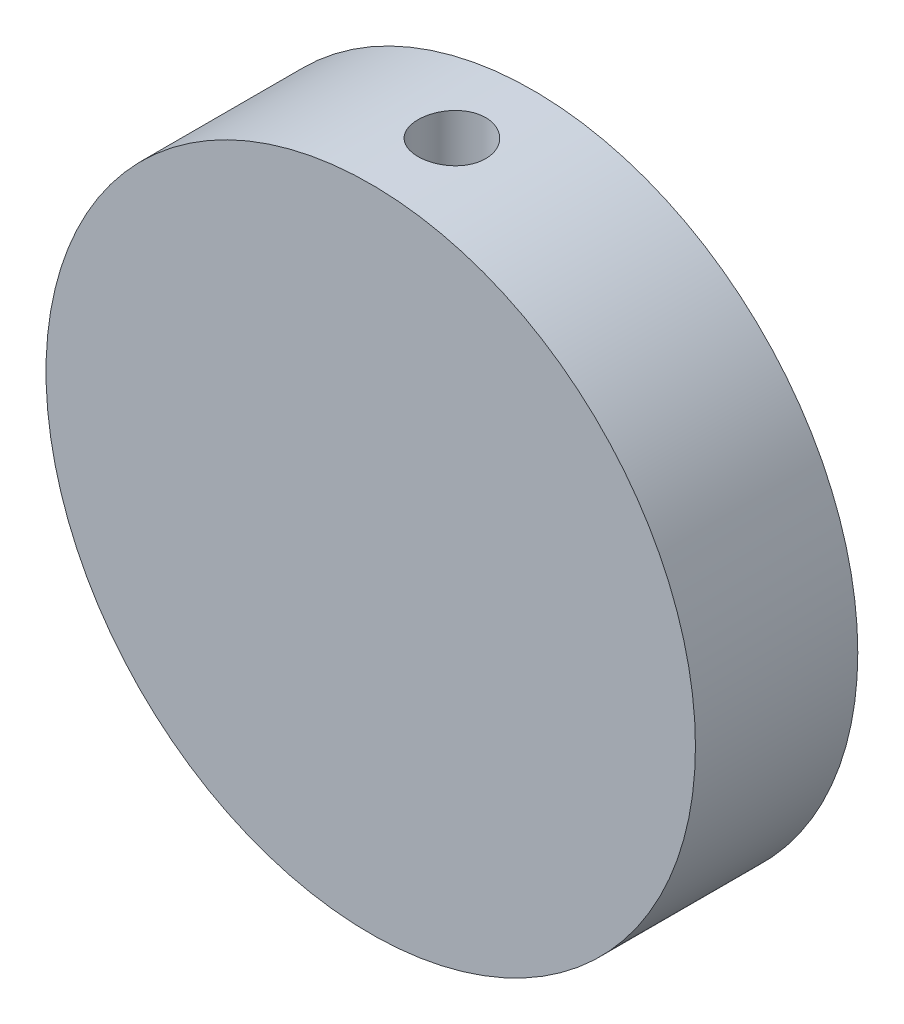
ISO-10303-21;
HEADER;
FILE_DESCRIPTION(('STEP AP214'),'2;1');
FILE_NAME('part.step','',(''),(''),'','','');
FILE_SCHEMA(('AUTOMOTIVE_DESIGN { 1 0 10303 214 1 1 1 1 }'));
ENDSEC;
DATA;
#1=APPLICATION_CONTEXT('core data for automotive mechanical design processes');
#2=APPLICATION_PROTOCOL_DEFINITION('international standard','automotive_design',2000,#1);
#3=PRODUCT_CONTEXT('',#1,'mechanical');
#4=PRODUCT('Part','Part','',(#3));
#5=PRODUCT_RELATED_PRODUCT_CATEGORY('part','',(#4));
#6=PRODUCT_DEFINITION_FORMATION('','',#4);
#7=PRODUCT_DEFINITION_CONTEXT('part definition',#1,'design');
#8=PRODUCT_DEFINITION('design','',#6,#7);
#9=PRODUCT_DEFINITION_SHAPE('','',#8);
#10=(LENGTH_UNIT() NAMED_UNIT(*) SI_UNIT(.MILLI.,.METRE.));
#11=(NAMED_UNIT(*) PLANE_ANGLE_UNIT() SI_UNIT($,.RADIAN.));
#12=(NAMED_UNIT(*) SI_UNIT($,.STERADIAN.) SOLID_ANGLE_UNIT());
#13=UNCERTAINTY_MEASURE_WITH_UNIT(LENGTH_MEASURE(1.E-05),#10,'distance_accuracy_value','');
#14=(GEOMETRIC_REPRESENTATION_CONTEXT(3) GLOBAL_UNCERTAINTY_ASSIGNED_CONTEXT((#13)) GLOBAL_UNIT_ASSIGNED_CONTEXT((#10,
#11,#12)) REPRESENTATION_CONTEXT('',''));
#15=CARTESIAN_POINT('',(0.,0.,0.));
#16=DIRECTION('',(0.,0.,1.));
#17=DIRECTION('',(1.,0.,0.));
#18=AXIS2_PLACEMENT_3D('',#15,#16,#17);
#19=CARTESIAN_POINT('',(0.,0.,6.));
#20=DIRECTION('',(0.,0.,-1.));
#21=DIRECTION('',(-1.,0.,0.));
#22=AXIS2_PLACEMENT_3D('',#19,#20,#21);
#23=CYLINDRICAL_SURFACE('',#22,12.);
#24=CARTESIAN_POINT('',(0.,-12.,4.25));
#25=CARTESIAN_POINT('',(0.0700095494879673,-11.9999991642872,4.2499969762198));
#26=CARTESIAN_POINT('',(0.140065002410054,-11.9993808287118,4.24409858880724));
#27=CARTESIAN_POINT('',(0.278232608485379,-11.9969736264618,4.22065842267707));
#28=CARTESIAN_POINT('',(0.346342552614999,-11.9951834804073,4.20310391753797));
#29=CARTESIAN_POINT('',(0.478598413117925,-11.9906346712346,4.15686904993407));
#30=CARTESIAN_POINT('',(0.542746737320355,-11.9878766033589,4.12819552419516));
#31=CARTESIAN_POINT('',(0.66530650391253,-11.9817001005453,4.06055009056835));
#32=CARTESIAN_POINT('',(0.723719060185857,-11.9782817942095,4.02158018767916));
#33=CARTESIAN_POINT('',(0.833390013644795,-11.9711526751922,3.93428570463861));
#34=CARTESIAN_POINT('',(0.884622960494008,-11.9674408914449,3.88592922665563));
#35=CARTESIAN_POINT('',(0.978261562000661,-11.9601511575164,3.78130238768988));
#36=CARTESIAN_POINT('',(1.02066680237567,-11.9565732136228,3.72503165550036));
#37=CARTESIAN_POINT('',(1.09553719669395,-11.9499464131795,3.60601329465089));
#38=CARTESIAN_POINT('',(1.12797918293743,-11.9468987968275,3.54325101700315));
#39=CARTESIAN_POINT('',(1.18185422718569,-11.9416898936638,3.41313259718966));
#40=CARTESIAN_POINT('',(1.20328757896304,-11.9395285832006,3.34577657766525));
#41=CARTESIAN_POINT('',(1.23446116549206,-11.9363458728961,3.20864305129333));
#42=CARTESIAN_POINT('',(1.24424374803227,-11.9353203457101,3.13887526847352));
#43=CARTESIAN_POINT('',(1.25196903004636,-11.9345125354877,2.99868114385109));
#44=CARTESIAN_POINT('',(1.24991206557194,-11.9347302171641,2.928254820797));
#45=CARTESIAN_POINT('',(1.23405152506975,-11.9363804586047,2.78903516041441));
#46=CARTESIAN_POINT('',(1.22029424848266,-11.9378082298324,2.72023648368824));
#47=CARTESIAN_POINT('',(1.1814956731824,-11.9417102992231,2.58592983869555));
#48=CARTESIAN_POINT('',(1.1564542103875,-11.9441846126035,2.52042191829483));
#49=CARTESIAN_POINT('',(1.09574719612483,-11.9499064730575,2.39441042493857));
#50=CARTESIAN_POINT('',(1.06006116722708,-11.953155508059,2.33391678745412));
#51=CARTESIAN_POINT('',(0.97909272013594,-11.9600594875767,2.21975979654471));
#52=CARTESIAN_POINT('',(0.93380999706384,-11.9637144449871,2.16609666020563));
#53=CARTESIAN_POINT('',(0.834675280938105,-11.9710397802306,2.06685497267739));
#54=CARTESIAN_POINT('',(0.780783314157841,-11.97471014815,2.02131634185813));
#55=CARTESIAN_POINT('',(0.666098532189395,-11.9816362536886,1.93992596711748));
#56=CARTESIAN_POINT('',(0.605305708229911,-11.9848919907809,1.90407423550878));
#57=CARTESIAN_POINT('',(0.478516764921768,-11.9906232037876,1.84307671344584));
#58=CARTESIAN_POINT('',(0.412519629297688,-11.9930985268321,1.81793302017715));
#59=CARTESIAN_POINT('',(0.277208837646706,-11.9969884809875,1.77909493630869));
#60=CARTESIAN_POINT('',(0.2078952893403,-11.9984031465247,1.7654001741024));
#61=CARTESIAN_POINT('',(0.0682648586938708,-12.0000079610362,1.74989950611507));
#62=CARTESIAN_POINT('',(-0.00204584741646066,-12.0002037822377,1.74803852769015));
#63=CARTESIAN_POINT('',(-0.141978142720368,-11.9993640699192,1.75611350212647));
#64=CARTESIAN_POINT('',(-0.211599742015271,-11.9983285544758,1.76604928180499));
#65=CARTESIAN_POINT('',(-0.348018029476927,-11.995146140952,1.79739003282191));
#66=CARTESIAN_POINT('',(-0.414820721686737,-11.9930017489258,1.81876914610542));
#67=CARTESIAN_POINT('',(-0.54389172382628,-11.98784207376,1.8723630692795));
#68=CARTESIAN_POINT('',(-0.606159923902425,-11.9848267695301,1.9045781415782));
#69=CARTESIAN_POINT('',(-0.72464291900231,-11.9782482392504,1.97906558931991));
#70=CARTESIAN_POINT('',(-0.780834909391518,-11.9746830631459,2.02137406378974));
#71=CARTESIAN_POINT('',(-0.885339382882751,-11.9674108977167,2.11479567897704));
#72=CARTESIAN_POINT('',(-0.933651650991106,-11.9637039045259,2.16590905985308));
#73=CARTESIAN_POINT('',(-1.02121712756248,-11.9565487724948,2.27573022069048));
#74=CARTESIAN_POINT('',(-1.06043413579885,-11.9531017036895,2.33446694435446));
#75=CARTESIAN_POINT('',(-1.12844682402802,-11.9468731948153,2.45772506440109));
#76=CARTESIAN_POINT('',(-1.15724265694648,-11.9440917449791,2.52224637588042));
#77=CARTESIAN_POINT('',(-1.2035352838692,-11.9395161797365,2.65511911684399));
#78=CARTESIAN_POINT('',(-1.22105344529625,-11.9377201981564,2.72346303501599));
#79=CARTESIAN_POINT('',(-1.24436270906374,-11.9353131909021,2.86214200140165));
#80=CARTESIAN_POINT('',(-1.25015417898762,-11.9347021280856,2.93247698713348));
#81=CARTESIAN_POINT('',(-1.24984031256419,-11.9347349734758,3.07278169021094));
#82=CARTESIAN_POINT('',(-1.24379184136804,-11.9353728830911,3.14275154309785));
#83=CARTESIAN_POINT('',(-1.22008919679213,-11.9378189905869,3.28067522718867));
#84=CARTESIAN_POINT('',(-1.20243501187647,-11.9396271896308,3.3486290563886));
#85=CARTESIAN_POINT('',(-1.15603809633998,-11.9442084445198,3.48059021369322));
#86=CARTESIAN_POINT('',(-1.12729720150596,-11.9469813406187,3.54459819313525));
#87=CARTESIAN_POINT('',(-1.05954851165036,-11.9531798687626,3.66689090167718));
#88=CARTESIAN_POINT('',(-1.02054074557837,-11.9566054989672,3.7251756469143));
#89=CARTESIAN_POINT('',(-0.933152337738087,-11.9637432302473,3.83465878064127));
#90=CARTESIAN_POINT('',(-0.884729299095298,-11.9674565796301,3.88582324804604));
#91=CARTESIAN_POINT('',(-0.779969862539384,-11.9747399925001,3.97932465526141));
#92=CARTESIAN_POINT('',(-0.723631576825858,-11.9783100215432,4.02165948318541));
#93=CARTESIAN_POINT('',(-0.60447247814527,-11.9849147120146,4.09639142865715));
#94=CARTESIAN_POINT('',(-0.541634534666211,-11.9879478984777,4.12876134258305));
#95=CARTESIAN_POINT('',(-0.411422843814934,-11.9931213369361,4.18244649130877));
#96=CARTESIAN_POINT('',(-0.344054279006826,-11.9952625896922,4.20377412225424));
#97=CARTESIAN_POINT('',(-0.230257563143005,-11.9978761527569,4.22948318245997));
#98=CARTESIAN_POINT('',(-0.184555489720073,-11.998668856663,4.23716639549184));
#99=CARTESIAN_POINT('',(-0.0925756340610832,-11.999731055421,4.2474257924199));
#100=CARTESIAN_POINT('',(-0.0462978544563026,-12.0000005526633,4.25000199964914));
#101=CARTESIAN_POINT('',(0.,-12.,4.25));
#102=B_SPLINE_CURVE_WITH_KNOTS('',3,(#24,#25,#26,#27,#28,#29,#30,#31,#32,#33,#34,#35,#36,#37,
#38,#39,#40,#41,#42,#43,#44,#45,#46,#47,#48,#49,#50,#51,#52,#53,#54,#55,#56,#57,#58,#59,#60,#61,
#62,#63,#64,#65,#66,#67,#68,#69,#70,#71,#72,#73,#74,#75,#76,#77,#78,#79,#80,#81,#82,#83,#84,#85,
#86,#87,#88,#89,#90,#91,#92,#93,#94,#95,#96,#97,#98,#99,#100,#101),.UNSPECIFIED.,.T.,.F.,(4,2,2,
2,2,2,2,2,2,2,2,2,2,2,2,2,2,2,2,2,2,2,2,2,2,2,2,2,2,2,2,2,2,2,2,2,2,2,4),(0.,0.209859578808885,
0.419948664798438,0.62990877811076,0.839828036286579,1.05047354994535,1.26112894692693,
1.47227053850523,1.68340649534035,1.89377265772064,2.1041328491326,2.31366447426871,
2.52319914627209,2.73313953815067,2.94308660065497,3.15403842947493,3.36499052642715,
3.57598391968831,3.78697046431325,3.99697438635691,4.20697522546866,4.41650352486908,
4.62603689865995,4.83633120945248,5.04663125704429,5.25775448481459,5.46887461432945,
5.67959355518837,5.89030589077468,6.10000869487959,6.30971170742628,6.51938001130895,
6.72904772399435,6.93968239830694,7.15036739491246,7.36162255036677,7.57264003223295,
7.71142242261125,7.85020417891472),.UNSPECIFIED.);
#103=CARTESIAN_POINT('',(0.,-12.,4.25));
#104=VERTEX_POINT('',#103);
#105=EDGE_CURVE('E37',#104,#104,#102,.T.);
#106=ORIENTED_EDGE('',*,*,#105,.T.);
#107=EDGE_LOOP('',(#106));
#108=FACE_BOUND('',#107,.T.);
#109=CARTESIAN_POINT('',(0.,12.,4.25));
#110=CARTESIAN_POINT('',(-0.0700095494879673,11.9999991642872,4.2499969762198));
#111=CARTESIAN_POINT('',(-0.140065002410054,11.9993808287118,4.24409858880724));
#112=CARTESIAN_POINT('',(-0.278232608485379,11.9969736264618,4.22065842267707));
#113=CARTESIAN_POINT('',(-0.346342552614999,11.9951834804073,4.20310391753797));
#114=CARTESIAN_POINT('',(-0.478598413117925,11.9906346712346,4.15686904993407));
#115=CARTESIAN_POINT('',(-0.542746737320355,11.9878766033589,4.12819552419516));
#116=CARTESIAN_POINT('',(-0.66530650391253,11.9817001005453,4.06055009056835));
#117=CARTESIAN_POINT('',(-0.723719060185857,11.9782817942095,4.02158018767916));
#118=CARTESIAN_POINT('',(-0.833390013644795,11.9711526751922,3.93428570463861));
#119=CARTESIAN_POINT('',(-0.884622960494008,11.9674408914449,3.88592922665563));
#120=CARTESIAN_POINT('',(-0.978261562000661,11.9601511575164,3.78130238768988));
#121=CARTESIAN_POINT('',(-1.02066680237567,11.9565732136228,3.72503165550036));
#122=CARTESIAN_POINT('',(-1.09553719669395,11.9499464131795,3.60601329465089));
#123=CARTESIAN_POINT('',(-1.12797918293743,11.9468987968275,3.54325101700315));
#124=CARTESIAN_POINT('',(-1.18185422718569,11.9416898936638,3.41313259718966));
#125=CARTESIAN_POINT('',(-1.20328757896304,11.9395285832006,3.34577657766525));
#126=CARTESIAN_POINT('',(-1.23446116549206,11.9363458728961,3.20864305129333));
#127=CARTESIAN_POINT('',(-1.24424374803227,11.9353203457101,3.13887526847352));
#128=CARTESIAN_POINT('',(-1.25196903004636,11.9345125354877,2.99868114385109));
#129=CARTESIAN_POINT('',(-1.24991206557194,11.9347302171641,2.928254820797));
#130=CARTESIAN_POINT('',(-1.23405152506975,11.9363804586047,2.78903516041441));
#131=CARTESIAN_POINT('',(-1.22029424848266,11.9378082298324,2.72023648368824));
#132=CARTESIAN_POINT('',(-1.1814956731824,11.9417102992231,2.58592983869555));
#133=CARTESIAN_POINT('',(-1.1564542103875,11.9441846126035,2.52042191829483));
#134=CARTESIAN_POINT('',(-1.09574719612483,11.9499064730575,2.39441042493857));
#135=CARTESIAN_POINT('',(-1.06006116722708,11.953155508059,2.33391678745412));
#136=CARTESIAN_POINT('',(-0.97909272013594,11.9600594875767,2.21975979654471));
#137=CARTESIAN_POINT('',(-0.93380999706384,11.9637144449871,2.16609666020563));
#138=CARTESIAN_POINT('',(-0.834675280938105,11.9710397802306,2.06685497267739));
#139=CARTESIAN_POINT('',(-0.780783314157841,11.97471014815,2.02131634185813));
#140=CARTESIAN_POINT('',(-0.666098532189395,11.9816362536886,1.93992596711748));
#141=CARTESIAN_POINT('',(-0.605305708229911,11.9848919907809,1.90407423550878));
#142=CARTESIAN_POINT('',(-0.478516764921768,11.9906232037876,1.84307671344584));
#143=CARTESIAN_POINT('',(-0.412519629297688,11.9930985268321,1.81793302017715));
#144=CARTESIAN_POINT('',(-0.277208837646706,11.9969884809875,1.77909493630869));
#145=CARTESIAN_POINT('',(-0.2078952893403,11.9984031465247,1.7654001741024));
#146=CARTESIAN_POINT('',(-0.0682648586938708,12.0000079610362,1.74989950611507));
#147=CARTESIAN_POINT('',(0.00204584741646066,12.0002037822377,1.74803852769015));
#148=CARTESIAN_POINT('',(0.141978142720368,11.9993640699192,1.75611350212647));
#149=CARTESIAN_POINT('',(0.211599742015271,11.9983285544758,1.76604928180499));
#150=CARTESIAN_POINT('',(0.348018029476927,11.995146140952,1.79739003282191));
#151=CARTESIAN_POINT('',(0.414820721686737,11.9930017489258,1.81876914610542));
#152=CARTESIAN_POINT('',(0.54389172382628,11.98784207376,1.8723630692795));
#153=CARTESIAN_POINT('',(0.606159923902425,11.9848267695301,1.9045781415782));
#154=CARTESIAN_POINT('',(0.72464291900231,11.9782482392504,1.97906558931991));
#155=CARTESIAN_POINT('',(0.780834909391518,11.9746830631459,2.02137406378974));
#156=CARTESIAN_POINT('',(0.885339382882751,11.9674108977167,2.11479567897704));
#157=CARTESIAN_POINT('',(0.933651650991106,11.9637039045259,2.16590905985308));
#158=CARTESIAN_POINT('',(1.02121712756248,11.9565487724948,2.27573022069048));
#159=CARTESIAN_POINT('',(1.06043413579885,11.9531017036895,2.33446694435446));
#160=CARTESIAN_POINT('',(1.12844682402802,11.9468731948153,2.45772506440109));
#161=CARTESIAN_POINT('',(1.15724265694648,11.9440917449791,2.52224637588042));
#162=CARTESIAN_POINT('',(1.2035352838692,11.9395161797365,2.65511911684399));
#163=CARTESIAN_POINT('',(1.22105344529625,11.9377201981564,2.72346303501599));
#164=CARTESIAN_POINT('',(1.24436270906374,11.9353131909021,2.86214200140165));
#165=CARTESIAN_POINT('',(1.25015417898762,11.9347021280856,2.93247698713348));
#166=CARTESIAN_POINT('',(1.24984031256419,11.9347349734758,3.07278169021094));
#167=CARTESIAN_POINT('',(1.24379184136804,11.9353728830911,3.14275154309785));
#168=CARTESIAN_POINT('',(1.22008919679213,11.9378189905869,3.28067522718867));
#169=CARTESIAN_POINT('',(1.20243501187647,11.9396271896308,3.3486290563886));
#170=CARTESIAN_POINT('',(1.15603809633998,11.9442084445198,3.48059021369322));
#171=CARTESIAN_POINT('',(1.12729720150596,11.9469813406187,3.54459819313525));
#172=CARTESIAN_POINT('',(1.05954851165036,11.9531798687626,3.66689090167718));
#173=CARTESIAN_POINT('',(1.02054074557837,11.9566054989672,3.7251756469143));
#174=CARTESIAN_POINT('',(0.933152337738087,11.9637432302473,3.83465878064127));
#175=CARTESIAN_POINT('',(0.884729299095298,11.9674565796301,3.88582324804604));
#176=CARTESIAN_POINT('',(0.779969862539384,11.9747399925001,3.97932465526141));
#177=CARTESIAN_POINT('',(0.723631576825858,11.9783100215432,4.02165948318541));
#178=CARTESIAN_POINT('',(0.60447247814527,11.9849147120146,4.09639142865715));
#179=CARTESIAN_POINT('',(0.541634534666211,11.9879478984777,4.12876134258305));
#180=CARTESIAN_POINT('',(0.411422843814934,11.9931213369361,4.18244649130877));
#181=CARTESIAN_POINT('',(0.344054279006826,11.9952625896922,4.20377412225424));
#182=CARTESIAN_POINT('',(0.230257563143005,11.9978761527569,4.22948318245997));
#183=CARTESIAN_POINT('',(0.184555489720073,11.998668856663,4.23716639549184));
#184=CARTESIAN_POINT('',(0.0925756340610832,11.999731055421,4.2474257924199));
#185=CARTESIAN_POINT('',(0.0462978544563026,12.0000005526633,4.25000199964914));
#186=CARTESIAN_POINT('',(0.,12.,4.25));
#187=B_SPLINE_CURVE_WITH_KNOTS('',3,(#109,#110,#111,#112,#113,#114,#115,#116,#117,#118,#119,
#120,#121,#122,#123,#124,#125,#126,#127,#128,#129,#130,#131,#132,#133,#134,#135,#136,#137,#138,
#139,#140,#141,#142,#143,#144,#145,#146,#147,#148,#149,#150,#151,#152,#153,#154,#155,#156,#157,
#158,#159,#160,#161,#162,#163,#164,#165,#166,#167,#168,#169,#170,#171,#172,#173,#174,#175,#176,
#177,#178,#179,#180,#181,#182,#183,#184,#185,#186),.UNSPECIFIED.,.T.,.F.,(4,2,2,2,2,2,2,2,2,2,2,
2,2,2,2,2,2,2,2,2,2,2,2,2,2,2,2,2,2,2,2,2,2,2,2,2,2,2,4),(0.,0.209859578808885,
0.419948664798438,0.62990877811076,0.839828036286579,1.05047354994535,1.26112894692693,
1.47227053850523,1.68340649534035,1.89377265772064,2.1041328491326,2.31366447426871,
2.52319914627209,2.73313953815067,2.94308660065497,3.15403842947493,3.36499052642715,
3.57598391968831,3.78697046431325,3.99697438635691,4.20697522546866,4.41650352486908,
4.62603689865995,4.83633120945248,5.04663125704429,5.25775448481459,5.46887461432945,
5.67959355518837,5.89030589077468,6.10000869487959,6.30971170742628,6.51938001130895,
6.72904772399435,6.93968239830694,7.15036739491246,7.36162255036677,7.57264003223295,
7.71142242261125,7.85020417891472),.UNSPECIFIED.);
#188=CARTESIAN_POINT('',(0.,12.,4.25));
#189=VERTEX_POINT('',#188);
#190=EDGE_CURVE('E51',#189,#189,#187,.T.);
#191=ORIENTED_EDGE('',*,*,#190,.T.);
#192=EDGE_LOOP('',(#191));
#193=FACE_BOUND('',#192,.T.);
#194=CARTESIAN_POINT('',(0.,0.,6.));
#195=DIRECTION('',(0.,0.,1.));
#196=DIRECTION('',(1.,0.,0.));
#197=AXIS2_PLACEMENT_3D('',#194,#195,#196);
#198=CIRCLE('',#197,12.);
#199=CARTESIAN_POINT('',(12.,0.,6.));
#200=VERTEX_POINT('',#199);
#201=EDGE_CURVE('E10',#200,#200,#198,.T.);
#202=ORIENTED_EDGE('',*,*,#201,.F.);
#203=EDGE_LOOP('',(#202));
#204=FACE_BOUND('',#203,.T.);
#205=CARTESIAN_POINT('',(0.,0.,0.));
#206=DIRECTION('',(0.,0.,1.));
#207=DIRECTION('',(1.,0.,0.));
#208=AXIS2_PLACEMENT_3D('',#205,#206,#207);
#209=CIRCLE('',#208,12.);
#210=CARTESIAN_POINT('',(12.,0.,0.));
#211=VERTEX_POINT('',#210);
#212=EDGE_CURVE('E45',#211,#211,#209,.T.);
#213=ORIENTED_EDGE('',*,*,#212,.T.);
#214=EDGE_LOOP('',(#213));
#215=FACE_BOUND('',#214,.T.);
#216=ADVANCED_FACE('F33',(#108,#193,#204,#215),#23,.T.);
#217=CARTESIAN_POINT('',(0.,0.,6.));
#218=DIRECTION('',(0.,0.,1.));
#219=DIRECTION('',(1.,0.,0.));
#220=AXIS2_PLACEMENT_3D('',#217,#218,#219);
#221=PLANE('',#220);
#222=ORIENTED_EDGE('',*,*,#201,.T.);
#223=EDGE_LOOP('',(#222));
#224=FACE_BOUND('',#223,.T.);
#225=ADVANCED_FACE('F64',(#224),#221,.T.);
#226=CARTESIAN_POINT('',(0.,0.,0.));
#227=DIRECTION('',(0.,0.,1.));
#228=DIRECTION('',(1.,0.,0.));
#229=AXIS2_PLACEMENT_3D('',#226,#227,#228);
#230=PLANE('',#229);
#231=ORIENTED_EDGE('',*,*,#212,.F.);
#232=EDGE_LOOP('',(#231));
#233=FACE_BOUND('',#232,.T.);
#234=ADVANCED_FACE('F60',(#233),#230,.F.);
#235=CARTESIAN_POINT('',(0.,-14.,3.));
#236=DIRECTION('',(0.,1.,0.));
#237=DIRECTION('',(0.,0.,1.));
#238=AXIS2_PLACEMENT_3D('',#235,#236,#237);
#239=CYLINDRICAL_SURFACE('',#238,1.25);
#240=ORIENTED_EDGE('',*,*,#190,.F.);
#241=EDGE_LOOP('',(#240));
#242=FACE_BOUND('',#241,.T.);
#243=ORIENTED_EDGE('',*,*,#105,.F.);
#244=EDGE_LOOP('',(#243));
#245=FACE_BOUND('',#244,.T.);
#246=ADVANCED_FACE('F56',(#242,#245),#239,.F.);
#247=CLOSED_SHELL('',(#216,#225,#234,#246));
#248=MANIFOLD_SOLID_BREP('B2',#247);
#249=ADVANCED_BREP_SHAPE_REPRESENTATION('',(#18,#248),#14);
#250=SHAPE_DEFINITION_REPRESENTATION(#9,#249);
ENDSEC;
END-ISO-10303-21;
